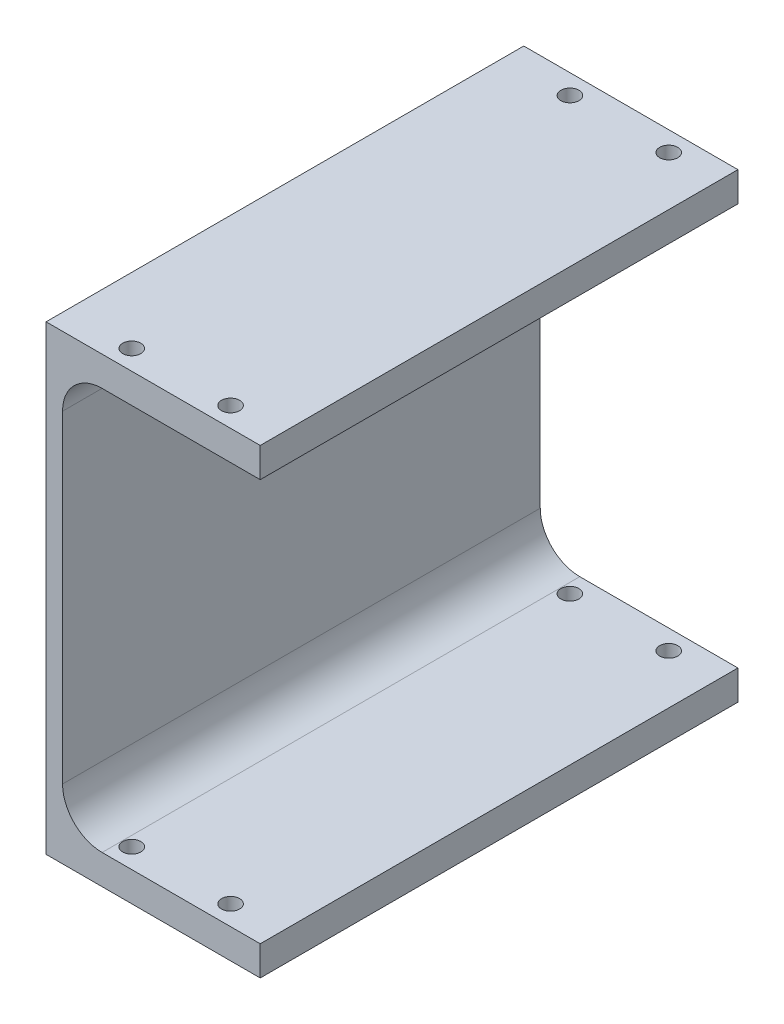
from build123d import *

# Parameters (mm, degrees)
EXTRUSION1_DEPTH = 72.5
CONG_1_R         = 12
D_GAGEMENT_M51_D = 5.5
ESQUISSE4_R      = 5
EXTRUSION2_DEPTH = 50


with BuildPart() as part:
    # Esquisse1 → Extrusion1 (new, symmetric)
    with BuildSketch(Plane.XY):
        Polygon((65, -61), (65, -70), (0, -70), (0, 70), (65, 70), (65, 61), (5, 61), (5, -61), align=None)
    extrude(amount=EXTRUSION1_DEPTH, both=True)

    # Cong_1
    cong_1_edges = [part.edges().sort_by_distance(p)[0] for p in [
        (5, 61, 0),
        (5, -61, 0),
    ]]
    fillet(cong_1_edges, radius=CONG_1_R)

    # D_gagement M51 (through all)
    with Locations(Plane(origin=(0, 70, 0), x_dir=(-1, 0, 0), z_dir=(0, 1, 0))):
        with Locations((-20, 66.5), (-20, -66.5), (-50, -66.5), (-50, 66.5)):
            Hole(D_GAGEMENT_M51_D / 2)


with BuildPart() as body_2:
    # Esquisse4 → Extrusion2 (new, symmetric)
    with BuildSketch(Plane.XY):
        with Locations(Location((15, -85, 0), (0, 0, 180))):
            Circle(ESQUISSE4_R)
    extrude(amount=EXTRUSION2_DEPTH, both=True)


solid = Compound([part.part, body_2.part])
